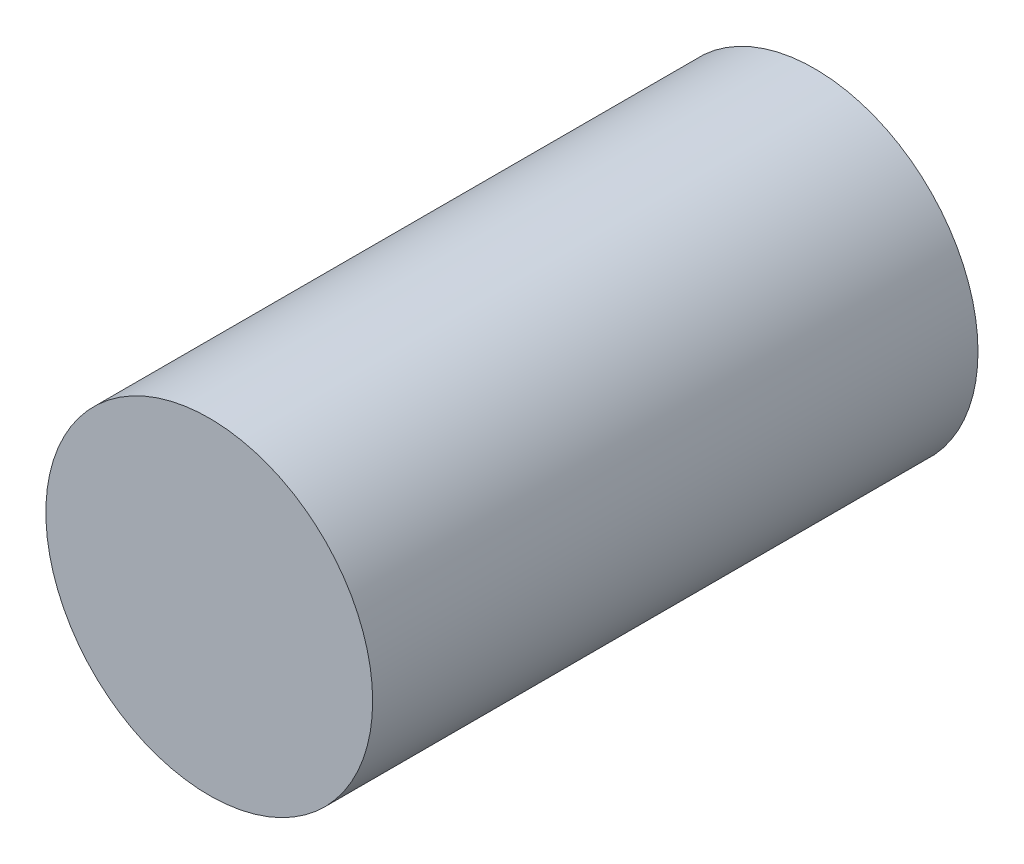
from build123d import *

# Parameters (mm, degrees)
SKETCH1_R      = 82.55
EXTRUDE1_DEPTH = 305.816


with BuildPart() as part:
    # Sketch1 → Extrude1 (new body)
    with BuildSketch(Plane.XY):
        Circle(SKETCH1_R)
    extrude(amount=-EXTRUDE1_DEPTH)


solid = part.part
